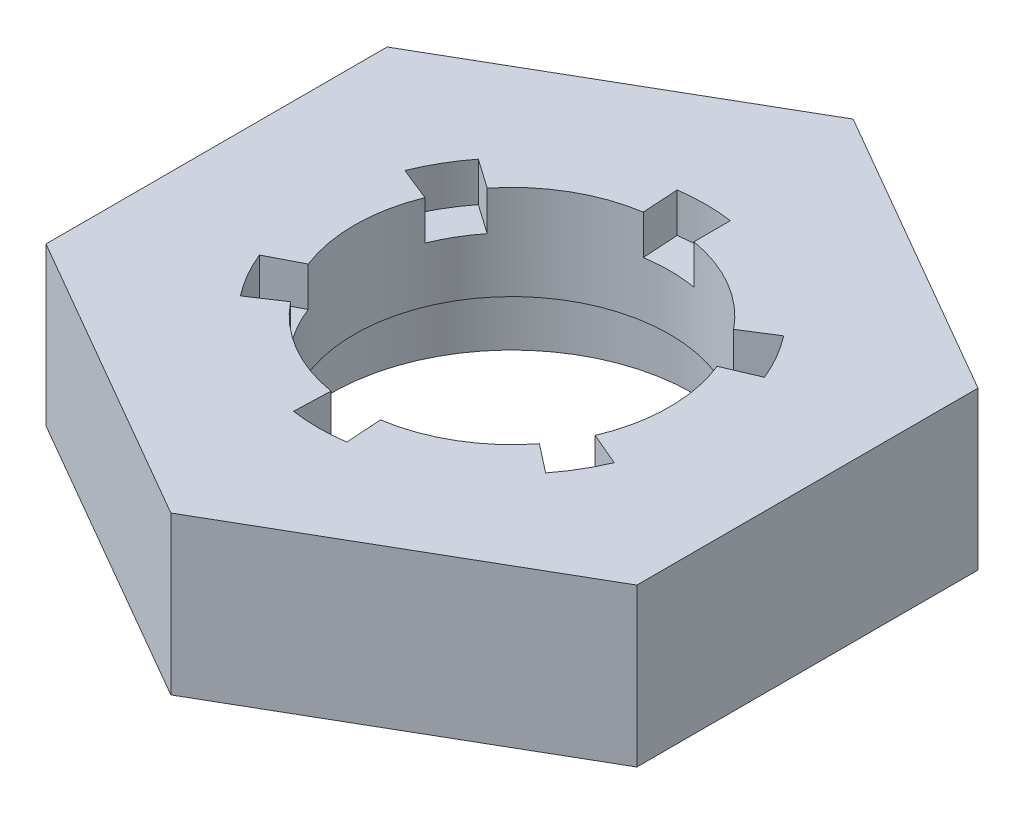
from build123d import *

# Parameters (mm, degrees)
SKETCH1_R           = 12.5
SKETCH1_R_2         = 10
BOSS_EXTRUDE6_DEPTH = 10
SKETCH10_R          = 11.5
CUT_EXTRUDE2_DEPTH  = 4
CUT_EXTRUDE5_START  = -2.5
CUT_EXTRUDE5_DEPTH  = 2.5


with BuildPart() as part:
    # Sketch1 → Boss-Extrude6 (new body)
    # profile 1 of 2: a face of its own
    with BuildSketch(Plane(origin=(0, 0, 0), x_dir=(1, 0, 0), z_dir=(0, 1, 0))):
        Polygon((56.25, 75.775317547), (37.5, 86.600635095), (18.75, 75.775317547), (18.75, 54.124682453), (37.5, 43.299364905), (56.25, 54.124682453), align=None)
        with Locations((37.5, 64.95)):
            Circle(SKETCH1_R, mode=Mode.SUBTRACT)
    # profile 2 of 2: a face of its own
    with BuildSketch(Plane(origin=(0, 0, 0), x_dir=(1, 0, 0), z_dir=(0, 1, 0))):
        with Locations((37.5, 64.95)):
            Circle(SKETCH1_R)
        with Locations(Location((37.5, 64.95, 0), (0, 0, 270))):
            Circle(SKETCH1_R_2, mode=Mode.SUBTRACT)
    extrude(amount=BOSS_EXTRUDE6_DEPTH)

    # Sketch10 → Cut-Extrude2 (cut)
    with BuildSketch(Plane.XZ):
        with Locations(Location((37.5, -64.95, 0), (0, 0, 270))):
            Circle(SKETCH10_R)
    extrude(amount=-CUT_EXTRUDE2_DEPTH, mode=Mode.SUBTRACT)

    # Sketch13 → Cut-Extrude5 (cut)
    with BuildSketch(Plane(origin=(0, 10, 0), x_dir=(1, 0, 0), z_dir=(0, 1, 0)).offset(CUT_EXTRUDE5_START)):
        with BuildLine():
            Line((26.140330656, 69.535108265), (28.228574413, 68.697087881))
            ThreePointArc((28.228574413, 68.697087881), (28.8671224, 69.9971204), (29.686773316, 71.19127301))
            Line((29.686773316, 71.19127301), (27.855429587, 72.470564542))
            Line((27.855429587, 72.470564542), (27.807048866, 72.504361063))
            ThreePointArc((27.807048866, 72.504361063), (26.853198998, 71.087369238), (26.105042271, 69.5518052))
            ThreePointArc((26.105042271, 69.5518052), (26.122638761, 69.543355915), (26.140330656, 69.535108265))
        make_face()
        with BuildLine():
            ThreePointArc((35.950743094, 74.82926126), (37.572051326, 74.949740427), (39.19145513, 74.805910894))
            Line((39.19145513, 74.805910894), (39.188518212, 77.122533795))
            ThreePointArc((39.188518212, 77.122533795), (37.500541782, 77.239087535), (35.812555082, 77.122682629))
            Line((35.812555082, 77.122682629), (35.950743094, 74.82926126))
        make_face()
        with BuildLine():
            ThreePointArc((45.264537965, 71.251741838), (46.113221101, 70.030592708), (46.771425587, 68.697087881))
            Line((46.771425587, 68.697087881), (48.818856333, 69.567572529))
            Line((48.818856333, 69.567572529), (48.878298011, 69.592844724))
            ThreePointArc((48.878298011, 69.592844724), (48.142662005, 71.094543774), (47.209970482, 72.482472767))
            Line((47.209970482, 72.482472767), (45.264537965, 71.251741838))
        make_face()
        with BuildLine():
            ThreePointArc((47.190717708, 57.392774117), (48.086884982, 58.709844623), (48.805148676, 60.131775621))
            Line((48.805148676, 60.131775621), (48.719997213, 60.168066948))
            Line((48.719997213, 60.168066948), (46.699339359, 61.029265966))
            ThreePointArc((46.699339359, 61.029265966), (46.114866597, 59.872197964), (45.385628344, 58.800458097))
            Line((45.385628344, 58.800458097), (47.190717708, 57.392774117))
        make_face()
        with BuildLine():
            add(Edge.make_bspline(
                [(39.187629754, 52.777342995), (39.110232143, 53.922760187), (39.032834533, 55.06817738)],
                knots=[0.082740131, 0.082740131, 0.082740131, 1, 1, 1], degree=2))
            ThreePointArc((39.032834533, 55.06817738), (37.456901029, 54.950092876), (35.882043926, 55.081757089))
            add(Edge.make_bspline(
                [(35.808181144, 52.864149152), (35.845112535, 53.972953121), (35.882043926, 55.081757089)],
                knots=[0.116862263, 0.116862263, 0.116862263, 1, 1, 1], degree=2))
            add(Edge.make_bspline(
                [(35.805322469, 52.778322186), (35.806751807, 52.821235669), (35.808181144, 52.864149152)],
                knots=[0.082682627, 0.082682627, 0.082682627, 0.116862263, 0.116862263, 0.116862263], degree=2))
            ThreePointArc((35.805322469, 52.778322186), (37.496442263, 52.660912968), (39.187629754, 52.777342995))
        make_face()
        with BuildLine():
            Line((27.807048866, 57.45870402), (29.686773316, 58.70872699))
            ThreePointArc((29.686773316, 58.70872699), (28.829965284, 59.966979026), (28.174069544, 61.340703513))
            add(Edge.make_bspline(
                [(26.129721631, 60.287549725), (27.151895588, 60.814126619), (28.174069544, 61.340703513)],
                knots=[0.055334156, 0.055334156, 0.055334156, 1, 1, 1], degree=2))
            ThreePointArc((26.129721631, 60.287549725), (26.856889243, 58.806233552), (27.775962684, 57.435695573))
            ThreePointArc((27.775962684, 57.435695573), (27.791573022, 57.447108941), (27.807048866, 57.45870402))
        make_face()
    extrude(amount=CUT_EXTRUDE5_DEPTH, mode=Mode.SUBTRACT)


solid = part.part
